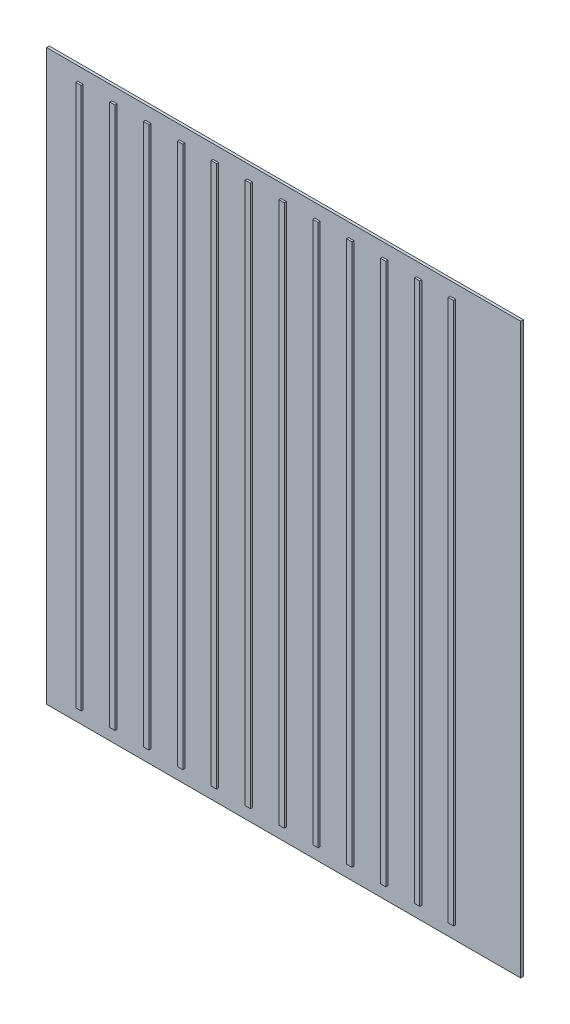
from build123d import *

# Parameters (mm, degrees)
SKETCH1_W           = 3500
SKETCH1_H           = 4200
BOSS_EXTRUDE1_DEPTH = 20
SKETCH2_W           = 40
SKETCH2_H           = 4000
BOSS_EXTRUDE2_DEPTH = 35


with BuildPart() as part:
    # Sketch1 → Boss-Extrude1 (new body)
    with BuildSketch(Plane.XY):
        with Locations((1750, 2100)):
            Rectangle(SKETCH1_W, SKETCH1_H)
    extrude(amount=BOSS_EXTRUDE1_DEPTH)

    # Sketch2 → Boss-Extrude2 (add)
    with BuildSketch(Plane.XY):
        with Locations((250, 2100)):
            Rectangle(SKETCH2_W, SKETCH2_H)
        with Locations((500, 2100)):
            Rectangle(SKETCH2_W, SKETCH2_H)
        with Locations((750, 2100)):
            Rectangle(SKETCH2_W, SKETCH2_H)
        with Locations((1000, 2100)):
            Rectangle(SKETCH2_W, SKETCH2_H)
        with Locations((1250, 2100)):
            Rectangle(SKETCH2_W, SKETCH2_H)
        with Locations((1500, 2100)):
            Rectangle(SKETCH2_W, SKETCH2_H)
        with Locations((1750, 2100)):
            Rectangle(SKETCH2_W, SKETCH2_H)
        with Locations((2000, 2100)):
            Rectangle(SKETCH2_W, SKETCH2_H)
        with Locations((2250, 2100)):
            Rectangle(SKETCH2_W, SKETCH2_H)
        with Locations((2500, 2100)):
            Rectangle(SKETCH2_W, SKETCH2_H)
        with Locations((2750, 2100)):
            Rectangle(SKETCH2_W, SKETCH2_H)
        with Locations((3000, 2100)):
            Rectangle(SKETCH2_W, SKETCH2_H)
    extrude(amount=BOSS_EXTRUDE2_DEPTH)


solid = part.part
